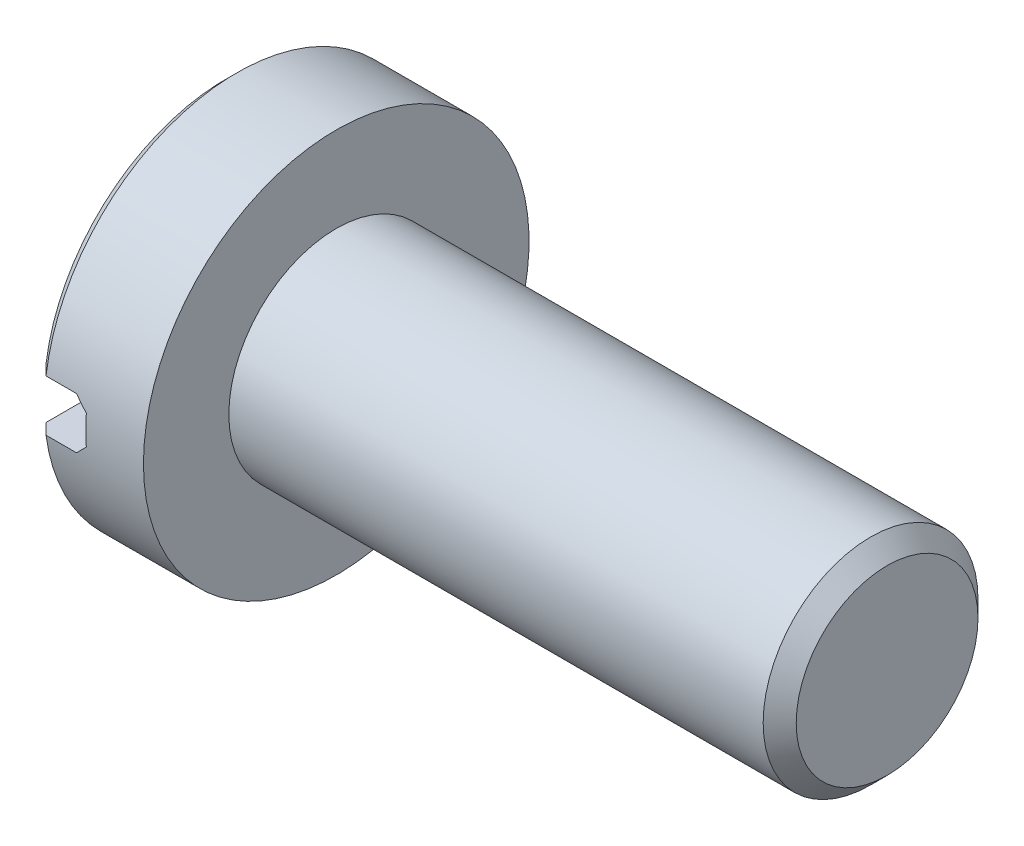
from build123d import *

# Parameters (mm, degrees)
ENL_V_MAT_EXTRU_1_DEPTH = 5
ESQUISSE3_R             = 1.95
EXTRUSION1_DEPTH        = 10
CHANFREIN1_SIZE         = 0.3


with BuildPart() as part:
    # Esquisse1 → R_volution1 (revolve)
    with BuildSketch(Plane.XY, mode=Mode.PRIVATE) as r_volution1_sk:
        Polygon((0, 0), (0, 3.3), (0.2, 3.5), (2, 3.5), (2, 0), align=None)
    revolve(r_volution1_sk.sketch.rotate(Axis((0, 0, 0), (1, 0, 0)), 90), axis=Axis((0, 0, 0), (1, 0, 0)))

    # Esquisse2 → Enl_v. mat.-Extru.1 (cut, symmetric)
    with BuildSketch(Plane.XY):
        Polygon((0, 0.465549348), (0.753445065, 0.465549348), (0.953445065, 0.265549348), (0.953445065, -0.265549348), (0.753445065, -0.465549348), (0, -0.465549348), align=None)
    extrude(amount=ENL_V_MAT_EXTRU_1_DEPTH, both=True, mode=Mode.SUBTRACT)

    # Esquisse3 → Extrusion1 (add)
    with BuildSketch(Plane(origin=(2, 0, 0), x_dir=(0, 0, -1), z_dir=(1, 0, 0))):
        with Locations(Location((0, 0, 0), (0, 0, 180))):
            Circle(ESQUISSE3_R)
    extrude(amount=EXTRUSION1_DEPTH)

    # Chanfrein1
    chanfrein1_edges = [part.edges().sort_by_distance(p)[0] for p in [
        (12, 0, -1.95),
    ]]
    chamfer(chanfrein1_edges, length=CHANFREIN1_SIZE)


solid = part.part
